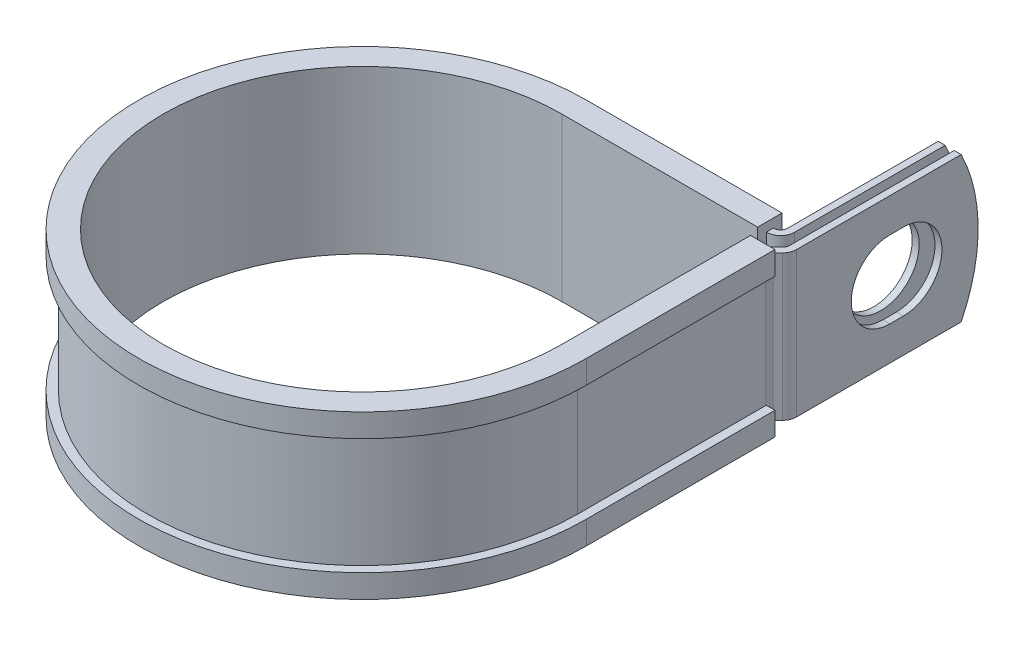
ISO-10303-21;
HEADER;
FILE_DESCRIPTION(('STEP AP214'),'2;1');
FILE_NAME('part.step','',(''),(''),'','','');
FILE_SCHEMA(('AUTOMOTIVE_DESIGN { 1 0 10303 214 1 1 1 1 }'));
ENDSEC;
DATA;
#1=APPLICATION_CONTEXT('core data for automotive mechanical design processes');
#2=APPLICATION_PROTOCOL_DEFINITION('international standard','automotive_design',2000,#1);
#3=PRODUCT_CONTEXT('',#1,'mechanical');
#4=PRODUCT('Part','Part','',(#3));
#5=PRODUCT_RELATED_PRODUCT_CATEGORY('part','',(#4));
#6=PRODUCT_DEFINITION_FORMATION('','',#4);
#7=PRODUCT_DEFINITION_CONTEXT('part definition',#1,'design');
#8=PRODUCT_DEFINITION('design','',#6,#7);
#9=PRODUCT_DEFINITION_SHAPE('','',#8);
#10=(LENGTH_UNIT() NAMED_UNIT(*) SI_UNIT(.MILLI.,.METRE.));
#11=(NAMED_UNIT(*) PLANE_ANGLE_UNIT() SI_UNIT($,.RADIAN.));
#12=(NAMED_UNIT(*) SI_UNIT($,.STERADIAN.) SOLID_ANGLE_UNIT());
#13=UNCERTAINTY_MEASURE_WITH_UNIT(LENGTH_MEASURE(1.E-05),#10,'distance_accuracy_value','');
#14=(GEOMETRIC_REPRESENTATION_CONTEXT(3) GLOBAL_UNCERTAINTY_ASSIGNED_CONTEXT((#13)) GLOBAL_UNIT_ASSIGNED_CONTEXT((#10,
#11,#12)) REPRESENTATION_CONTEXT('',''));
#15=CARTESIAN_POINT('',(0.,0.,0.));
#16=DIRECTION('',(0.,0.,1.));
#17=DIRECTION('',(1.,0.,0.));
#18=AXIS2_PLACEMENT_3D('',#15,#16,#17);
#19=CARTESIAN_POINT('',(37.1272698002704,-12.7,-36.449));
#20=DIRECTION('',(0.,1.,0.));
#21=DIRECTION('',(1.,0.,0.));
#22=AXIS2_PLACEMENT_3D('',#19,#20,#21);
#23=PLANE('',#22);
#24=DIRECTION('',(0.,0.,-1.));
#25=VECTOR('',#24,1.);
#26=CARTESIAN_POINT('',(34.2824698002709,-12.7,-36.449));
#27=LINE('',#26,#25);
#28=CARTESIAN_POINT('',(34.2824698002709,-12.7,-36.449));
#29=VERTEX_POINT('',#28);
#30=CARTESIAN_POINT('',(34.2824698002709,-12.7,-37.6682));
#31=VERTEX_POINT('',#30);
#32=EDGE_CURVE('E524',#29,#31,#27,.T.);
#33=ORIENTED_EDGE('',*,*,#32,.T.);
#34=DIRECTION('',(1.,0.,0.));
#35=VECTOR('',#34,1.);
#36=CARTESIAN_POINT('',(0.,-12.7,-37.6682));
#37=LINE('',#36,#35);
#38=CARTESIAN_POINT('',(34.3332698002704,-12.7,-37.6682));
#39=VERTEX_POINT('',#38);
#40=EDGE_CURVE('E411',#39,#31,#37,.F.);
#41=ORIENTED_EDGE('',*,*,#40,.F.);
#42=CARTESIAN_POINT('',(34.3332698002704,-12.7,-38.8874));
#43=DIRECTION('',(0.,1.,0.));
#44=DIRECTION('',(1.,0.,0.));
#45=AXIS2_PLACEMENT_3D('',#42,#43,#44);
#46=CIRCLE('',#45,1.2192);
#47=CARTESIAN_POINT('',(35.5524698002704,-12.7,-38.8874));
#48=VERTEX_POINT('',#47);
#49=EDGE_CURVE('E409',#48,#39,#46,.F.);
#50=ORIENTED_EDGE('',*,*,#49,.F.);
#51=DIRECTION('',(0.,0.,1.));
#52=VECTOR('',#51,1.);
#53=CARTESIAN_POINT('',(35.5524698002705,-12.7,-68.2498));
#54=LINE('',#53,#52);
#55=CARTESIAN_POINT('',(35.5524698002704,-12.7,-65.2724683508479));
#56=VERTEX_POINT('',#55);
#57=EDGE_CURVE('E407',#56,#48,#54,.T.);
#58=ORIENTED_EDGE('',*,*,#57,.F.);
#59=DIRECTION('',(-1.,0.,0.));
#60=VECTOR('',#59,1.);
#61=CARTESIAN_POINT('',(39.5656698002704,-12.7,-65.2724683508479));
#62=LINE('',#61,#60);
#63=CARTESIAN_POINT('',(36.7716698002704,-12.7,-65.2724683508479));
#64=VERTEX_POINT('',#63);
#65=EDGE_CURVE('E12',#64,#56,#62,.T.);
#66=ORIENTED_EDGE('',*,*,#65,.F.);
#67=DIRECTION('',(0.,0.,1.));
#68=VECTOR('',#67,1.);
#69=CARTESIAN_POINT('',(36.7716698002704,-12.7,-68.2498));
#70=LINE('',#69,#68);
#71=CARTESIAN_POINT('',(36.7716698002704,-12.7,-38.8874));
#72=VERTEX_POINT('',#71);
#73=EDGE_CURVE('E405',#64,#72,#70,.T.);
#74=ORIENTED_EDGE('',*,*,#73,.T.);
#75=CARTESIAN_POINT('',(34.3332698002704,-12.7,-38.8874));
#76=DIRECTION('',(0.,-1.,0.));
#77=DIRECTION('',(0.,0.,1.));
#78=AXIS2_PLACEMENT_3D('',#75,#76,#77);
#79=CIRCLE('',#78,2.4384);
#80=CARTESIAN_POINT('',(34.3332698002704,-12.7,-36.449));
#81=VERTEX_POINT('',#80);
#82=EDGE_CURVE('E402',#72,#81,#79,.T.);
#83=ORIENTED_EDGE('',*,*,#82,.T.);
#84=DIRECTION('',(-1.,0.,0.));
#85=VECTOR('',#84,1.);
#86=CARTESIAN_POINT('',(0.,-12.7,-36.449));
#87=LINE('',#86,#85);
#88=EDGE_CURVE('E399',#81,#29,#87,.T.);
#89=ORIENTED_EDGE('',*,*,#88,.T.);
#90=EDGE_LOOP('',(#33,#41,#50,#58,#66,#74,#83,#89));
#91=FACE_BOUND('',#90,.T.);
#92=ADVANCED_FACE('F55',(#91),#23,.F.);
#93=CARTESIAN_POINT('',(37.1272698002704,12.7,-36.449));
#94=DIRECTION('',(0.,1.,0.));
#95=DIRECTION('',(1.,0.,0.));
#96=AXIS2_PLACEMENT_3D('',#93,#94,#95);
#97=PLANE('',#96);
#98=DIRECTION('',(1.,0.,0.));
#99=VECTOR('',#98,1.);
#100=CARTESIAN_POINT('',(0.,12.7,-37.6682));
#101=LINE('',#100,#99);
#102=CARTESIAN_POINT('',(34.3332698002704,12.7,-37.6682));
#103=VERTEX_POINT('',#102);
#104=CARTESIAN_POINT('',(34.2824698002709,12.7,-37.6682));
#105=VERTEX_POINT('',#104);
#106=EDGE_CURVE('E369',#103,#105,#101,.F.);
#107=ORIENTED_EDGE('',*,*,#106,.T.);
#108=DIRECTION('',(0.,0.,1.));
#109=VECTOR('',#108,1.);
#110=CARTESIAN_POINT('',(34.2824698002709,12.7,-37.6682));
#111=LINE('',#110,#109);
#112=CARTESIAN_POINT('',(34.2824698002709,12.7,-36.449));
#113=VERTEX_POINT('',#112);
#114=EDGE_CURVE('E518',#105,#113,#111,.T.);
#115=ORIENTED_EDGE('',*,*,#114,.T.);
#116=DIRECTION('',(-1.,0.,0.));
#117=VECTOR('',#116,1.);
#118=CARTESIAN_POINT('',(0.,12.7,-36.449));
#119=LINE('',#118,#117);
#120=CARTESIAN_POINT('',(34.3332698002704,12.7,-36.449));
#121=VERTEX_POINT('',#120);
#122=EDGE_CURVE('E626',#121,#113,#119,.T.);
#123=ORIENTED_EDGE('',*,*,#122,.F.);
#124=CARTESIAN_POINT('',(34.3332698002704,12.7,-38.8874));
#125=DIRECTION('',(0.,-1.,0.));
#126=DIRECTION('',(0.,0.,1.));
#127=AXIS2_PLACEMENT_3D('',#124,#125,#126);
#128=CIRCLE('',#127,2.4384);
#129=CARTESIAN_POINT('',(36.7716698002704,12.7,-38.8874));
#130=VERTEX_POINT('',#129);
#131=EDGE_CURVE('E371',#130,#121,#128,.T.);
#132=ORIENTED_EDGE('',*,*,#131,.F.);
#133=DIRECTION('',(0.,0.,1.));
#134=VECTOR('',#133,1.);
#135=CARTESIAN_POINT('',(36.7716698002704,12.7,-68.2498));
#136=LINE('',#135,#134);
#137=CARTESIAN_POINT('',(36.7716698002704,12.7,-65.2724683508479));
#138=VERTEX_POINT('',#137);
#139=EDGE_CURVE('E362',#138,#130,#136,.T.);
#140=ORIENTED_EDGE('',*,*,#139,.F.);
#141=DIRECTION('',(-1.,0.,0.));
#142=VECTOR('',#141,1.);
#143=CARTESIAN_POINT('',(39.5656698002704,12.7,-65.2724683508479));
#144=LINE('',#143,#142);
#145=CARTESIAN_POINT('',(35.5524698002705,12.7,-65.2724683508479));
#146=VERTEX_POINT('',#145);
#147=EDGE_CURVE('E63',#138,#146,#144,.T.);
#148=ORIENTED_EDGE('',*,*,#147,.T.);
#149=DIRECTION('',(0.,0.,1.));
#150=VECTOR('',#149,1.);
#151=CARTESIAN_POINT('',(35.5524698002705,12.7,-68.2498));
#152=LINE('',#151,#150);
#153=CARTESIAN_POINT('',(35.5524698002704,12.7,-38.8874));
#154=VERTEX_POINT('',#153);
#155=EDGE_CURVE('E359',#146,#154,#152,.T.);
#156=ORIENTED_EDGE('',*,*,#155,.T.);
#157=CARTESIAN_POINT('',(34.3332698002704,12.7,-38.8874));
#158=DIRECTION('',(0.,1.,0.));
#159=DIRECTION('',(1.,0.,0.));
#160=AXIS2_PLACEMENT_3D('',#157,#158,#159);
#161=CIRCLE('',#160,1.2192);
#162=EDGE_CURVE('E367',#154,#103,#161,.F.);
#163=ORIENTED_EDGE('',*,*,#162,.T.);
#164=EDGE_LOOP('',(#107,#115,#123,#132,#140,#148,#156,#163));
#165=FACE_BOUND('',#164,.T.);
#166=ADVANCED_FACE('F358',(#165),#97,.T.);
#167=CARTESIAN_POINT('',(0.,12.7,-36.449));
#168=DIRECTION('',(0.,0.,1.));
#169=DIRECTION('',(1.,0.,0.));
#170=AXIS2_PLACEMENT_3D('',#167,#168,#169);
#171=PLANE('',#170);
#172=ORIENTED_EDGE('',*,*,#122,.T.);
#173=DIRECTION('',(0.,-1.,0.));
#174=VECTOR('',#173,1.);
#175=CARTESIAN_POINT('',(34.2824698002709,12.7,-36.449));
#176=LINE('',#175,#174);
#177=EDGE_CURVE('E521',#113,#29,#176,.T.);
#178=ORIENTED_EDGE('',*,*,#177,.T.);
#179=ORIENTED_EDGE('',*,*,#88,.F.);
#180=DIRECTION('',(0.,-1.,0.));
#181=VECTOR('',#180,1.);
#182=CARTESIAN_POINT('',(34.3332698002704,12.7,-36.449));
#183=LINE('',#182,#181);
#184=EDGE_CURVE('E345',#121,#81,#183,.T.);
#185=ORIENTED_EDGE('',*,*,#184,.F.);
#186=EDGE_LOOP('',(#172,#178,#179,#185));
#187=FACE_BOUND('',#186,.T.);
#188=ADVANCED_FACE('F636',(#187),#171,.T.);
#189=CARTESIAN_POINT('',(39.5656698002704,12.7,-36.449));
#190=DIRECTION('',(-1.,0.,0.));
#191=DIRECTION('',(0.,0.,1.));
#192=AXIS2_PLACEMENT_3D('',#189,#190,#191);
#193=PLANE('',#192);
#194=CARTESIAN_POINT('',(39.5656698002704,0.,-55.1687999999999));
#195=DIRECTION('',(1.,0.,0.));
#196=DIRECTION('',(0.,0.,-1.));
#197=AXIS2_PLACEMENT_3D('',#194,#195,#196);
#198=CIRCLE('',#197,6.7437);
#199=CARTESIAN_POINT('',(39.5656698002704,-6.7437,-55.1688000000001));
#200=VERTEX_POINT('',#199);
#201=CARTESIAN_POINT('',(39.5656698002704,6.7437,-55.1688000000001));
#202=VERTEX_POINT('',#201);
#203=EDGE_CURVE('E581',#200,#202,#198,.T.);
#204=ORIENTED_EDGE('',*,*,#203,.F.);
#205=DIRECTION('',(0.,0.,-1.));
#206=VECTOR('',#205,1.);
#207=CARTESIAN_POINT('',(39.5656698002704,-6.7437,-52.7811999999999));
#208=LINE('',#207,#206);
#209=CARTESIAN_POINT('',(39.5656698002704,-6.7437,-52.7811999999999));
#210=VERTEX_POINT('',#209);
#211=EDGE_CURVE('E584',#210,#200,#208,.T.);
#212=ORIENTED_EDGE('',*,*,#211,.F.);
#213=CARTESIAN_POINT('',(39.5656698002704,0.,-52.7811999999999));
#214=DIRECTION('',(1.,0.,0.));
#215=DIRECTION('',(0.,0.,-1.));
#216=AXIS2_PLACEMENT_3D('',#213,#214,#215);
#217=CIRCLE('',#216,6.7437);
#218=CARTESIAN_POINT('',(39.5656698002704,6.7437,-52.7811999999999));
#219=VERTEX_POINT('',#218);
#220=EDGE_CURVE('E577',#219,#210,#217,.T.);
#221=ORIENTED_EDGE('',*,*,#220,.F.);
#222=DIRECTION('',(0.,0.,1.));
#223=VECTOR('',#222,1.);
#224=CARTESIAN_POINT('',(39.5656698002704,6.7437,-52.7811999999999));
#225=LINE('',#224,#223);
#226=EDGE_CURVE('E578',#202,#219,#225,.T.);
#227=ORIENTED_EDGE('',*,*,#226,.F.);
#228=EDGE_LOOP('',(#204,#212,#221,#227));
#229=FACE_BOUND('',#228,.T.);
#230=DIRECTION('',(0.,0.,-1.));
#231=VECTOR('',#230,1.);
#232=CARTESIAN_POINT('',(39.5656698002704,-12.7,-36.449));
#233=LINE('',#232,#231);
#234=CARTESIAN_POINT('',(39.5656698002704,-12.7,-36.449));
#235=VERTEX_POINT('',#234);
#236=CARTESIAN_POINT('',(39.5656698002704,-12.7,-65.2724683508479));
#237=VERTEX_POINT('',#236);
#238=EDGE_CURVE('E383',#235,#237,#233,.T.);
#239=ORIENTED_EDGE('',*,*,#238,.T.);
#240=CARTESIAN_POINT('',(39.5656698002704,0.,-39.6748));
#241=DIRECTION('',(-1.,0.,0.));
#242=DIRECTION('',(0.,0.,1.));
#243=AXIS2_PLACEMENT_3D('',#240,#241,#242);
#244=CIRCLE('',#243,28.575);
#245=CARTESIAN_POINT('',(39.5656698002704,12.7,-65.2724683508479));
#246=VERTEX_POINT('',#245);
#247=EDGE_CURVE('E569',#246,#237,#244,.T.);
#248=ORIENTED_EDGE('',*,*,#247,.F.);
#249=DIRECTION('',(0.,0.,-1.));
#250=VECTOR('',#249,1.);
#251=CARTESIAN_POINT('',(39.5656698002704,12.7,-36.449));
#252=LINE('',#251,#250);
#253=CARTESIAN_POINT('',(39.5656698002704,12.7,-36.449));
#254=VERTEX_POINT('',#253);
#255=EDGE_CURVE('E420',#254,#246,#252,.T.);
#256=ORIENTED_EDGE('',*,*,#255,.F.);
#257=DIRECTION('',(0.,-1.,0.));
#258=VECTOR('',#257,1.);
#259=CARTESIAN_POINT('',(39.5656698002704,12.7,-36.449));
#260=LINE('',#259,#258);
#261=EDGE_CURVE('E382',#254,#235,#260,.T.);
#262=ORIENTED_EDGE('',*,*,#261,.T.);
#263=EDGE_LOOP('',(#239,#248,#256,#262));
#264=FACE_BOUND('',#263,.T.);
#265=ADVANCED_FACE('F57',(#229,#264),#193,.F.);
#266=CARTESIAN_POINT('',(38.3464698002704,12.7,-36.449));
#267=DIRECTION('',(-1.,0.,0.));
#268=DIRECTION('',(0.,0.,1.));
#269=AXIS2_PLACEMENT_3D('',#266,#267,#268);
#270=PLANE('',#269);
#271=DIRECTION('',(0.,0.,-1.));
#272=VECTOR('',#271,1.);
#273=CARTESIAN_POINT('',(38.3464698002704,-6.7437,-52.7811999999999));
#274=LINE('',#273,#272);
#275=CARTESIAN_POINT('',(38.3464698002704,-6.7437,-52.7811999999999));
#276=VERTEX_POINT('',#275);
#277=CARTESIAN_POINT('',(38.3464698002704,-6.7437,-55.1688000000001));
#278=VERTEX_POINT('',#277);
#279=EDGE_CURVE('E580',#276,#278,#274,.T.);
#280=ORIENTED_EDGE('',*,*,#279,.T.);
#281=CARTESIAN_POINT('',(38.3464698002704,0.,-55.1687999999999));
#282=DIRECTION('',(-1.,0.,0.));
#283=DIRECTION('',(0.,0.,1.));
#284=AXIS2_PLACEMENT_3D('',#281,#282,#283);
#285=CIRCLE('',#284,6.7437);
#286=CARTESIAN_POINT('',(38.3464698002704,6.7437,-55.1688000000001));
#287=VERTEX_POINT('',#286);
#288=EDGE_CURVE('E601',#278,#287,#285,.F.);
#289=ORIENTED_EDGE('',*,*,#288,.T.);
#290=DIRECTION('',(0.,0.,1.));
#291=VECTOR('',#290,1.);
#292=CARTESIAN_POINT('',(38.3464698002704,6.7437,-52.7811999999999));
#293=LINE('',#292,#291);
#294=CARTESIAN_POINT('',(38.3464698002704,6.7437,-52.7811999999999));
#295=VERTEX_POINT('',#294);
#296=EDGE_CURVE('E597',#287,#295,#293,.T.);
#297=ORIENTED_EDGE('',*,*,#296,.T.);
#298=CARTESIAN_POINT('',(38.3464698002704,0.,-52.7811999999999));
#299=DIRECTION('',(-1.,0.,0.));
#300=DIRECTION('',(0.,0.,1.));
#301=AXIS2_PLACEMENT_3D('',#298,#299,#300);
#302=CIRCLE('',#301,6.7437);
#303=EDGE_CURVE('E592',#295,#276,#302,.F.);
#304=ORIENTED_EDGE('',*,*,#303,.T.);
#305=EDGE_LOOP('',(#280,#289,#297,#304));
#306=FACE_BOUND('',#305,.T.);
#307=CARTESIAN_POINT('',(38.3464698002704,0.,-39.6748));
#308=DIRECTION('',(-1.,0.,0.));
#309=DIRECTION('',(0.,0.,1.));
#310=AXIS2_PLACEMENT_3D('',#307,#308,#309);
#311=CIRCLE('',#310,28.575);
#312=CARTESIAN_POINT('',(38.3464698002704,12.7,-65.2724683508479));
#313=VERTEX_POINT('',#312);
#314=CARTESIAN_POINT('',(38.3464698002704,-12.7,-65.2724683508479));
#315=VERTEX_POINT('',#314);
#316=EDGE_CURVE('E77',#313,#315,#311,.T.);
#317=ORIENTED_EDGE('',*,*,#316,.T.);
#318=DIRECTION('',(0.,0.,-1.));
#319=VECTOR('',#318,1.);
#320=CARTESIAN_POINT('',(38.3464698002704,-12.7,-36.449));
#321=LINE('',#320,#319);
#322=CARTESIAN_POINT('',(38.3464698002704,-12.7,-36.449));
#323=VERTEX_POINT('',#322);
#324=EDGE_CURVE('E386',#323,#315,#321,.T.);
#325=ORIENTED_EDGE('',*,*,#324,.F.);
#326=DIRECTION('',(0.,-1.,0.));
#327=VECTOR('',#326,1.);
#328=CARTESIAN_POINT('',(38.3464698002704,12.7,-36.449));
#329=LINE('',#328,#327);
#330=CARTESIAN_POINT('',(38.3464698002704,12.7,-36.449));
#331=VERTEX_POINT('',#330);
#332=EDGE_CURVE('E353',#331,#323,#329,.T.);
#333=ORIENTED_EDGE('',*,*,#332,.F.);
#334=DIRECTION('',(0.,0.,-1.));
#335=VECTOR('',#334,1.);
#336=CARTESIAN_POINT('',(38.3464698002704,12.7,-36.449));
#337=LINE('',#336,#335);
#338=EDGE_CURVE('E616',#331,#313,#337,.T.);
#339=ORIENTED_EDGE('',*,*,#338,.T.);
#340=EDGE_LOOP('',(#317,#325,#333,#339));
#341=FACE_BOUND('',#340,.T.);
#342=ADVANCED_FACE('F690',(#306,#341),#270,.T.);
#343=CARTESIAN_POINT('',(36.7716698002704,12.7,-68.2498));
#344=DIRECTION('',(1.,0.,0.));
#345=DIRECTION('',(0.,0.,-1.));
#346=AXIS2_PLACEMENT_3D('',#343,#344,#345);
#347=PLANE('',#346);
#348=CARTESIAN_POINT('',(36.7716698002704,0.,-53.975));
#349=DIRECTION('',(1.,0.,0.));
#350=DIRECTION('',(0.,0.,-1.));
#351=AXIS2_PLACEMENT_3D('',#348,#349,#350);
#352=CIRCLE('',#351,6.7437);
#353=CARTESIAN_POINT('',(36.7716698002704,0.,-60.7187));
#354=VERTEX_POINT('',#353);
#355=EDGE_CURVE('E387',#354,#354,#352,.F.);
#356=ORIENTED_EDGE('',*,*,#355,.T.);
#357=EDGE_LOOP('',(#356));
#358=FACE_BOUND('',#357,.T.);
#359=ORIENTED_EDGE('',*,*,#73,.F.);
#360=CARTESIAN_POINT('',(36.7716698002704,0.,-39.6748));
#361=DIRECTION('',(1.,0.,0.));
#362=DIRECTION('',(0.,0.,-1.));
#363=AXIS2_PLACEMENT_3D('',#360,#361,#362);
#364=CIRCLE('',#363,28.575);
#365=EDGE_CURVE('E574',#64,#138,#364,.T.);
#366=ORIENTED_EDGE('',*,*,#365,.T.);
#367=ORIENTED_EDGE('',*,*,#139,.T.);
#368=DIRECTION('',(0.,-1.,0.));
#369=VECTOR('',#368,1.);
#370=CARTESIAN_POINT('',(36.7716698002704,12.7,-38.8874));
#371=LINE('',#370,#369);
#372=EDGE_CURVE('E342',#130,#72,#371,.T.);
#373=ORIENTED_EDGE('',*,*,#372,.T.);
#374=EDGE_LOOP('',(#359,#366,#367,#373));
#375=FACE_BOUND('',#374,.T.);
#376=ADVANCED_FACE('F642',(#358,#375),#347,.T.);
#377=CARTESIAN_POINT('',(35.5524698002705,12.7,-68.2498));
#378=DIRECTION('',(1.,0.,0.));
#379=DIRECTION('',(0.,0.,-1.));
#380=AXIS2_PLACEMENT_3D('',#377,#378,#379);
#381=PLANE('',#380);
#382=CARTESIAN_POINT('',(35.5524698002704,0.,-53.975));
#383=DIRECTION('',(-1.,0.,0.));
#384=DIRECTION('',(0.,0.,1.));
#385=AXIS2_PLACEMENT_3D('',#382,#383,#384);
#386=CIRCLE('',#385,6.7437);
#387=CARTESIAN_POINT('',(35.5524698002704,0.,-47.2313));
#388=VERTEX_POINT('',#387);
#389=EDGE_CURVE('E609',#388,#388,#386,.T.);
#390=ORIENTED_EDGE('',*,*,#389,.F.);
#391=EDGE_LOOP('',(#390));
#392=FACE_BOUND('',#391,.T.);
#393=CARTESIAN_POINT('',(35.5524698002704,0.,-39.6748));
#394=DIRECTION('',(-1.,0.,0.));
#395=DIRECTION('',(0.,0.,1.));
#396=AXIS2_PLACEMENT_3D('',#393,#394,#395);
#397=CIRCLE('',#396,28.575);
#398=EDGE_CURVE('E69',#146,#56,#397,.T.);
#399=ORIENTED_EDGE('',*,*,#398,.T.);
#400=ORIENTED_EDGE('',*,*,#57,.T.);
#401=DIRECTION('',(0.,-1.,0.));
#402=VECTOR('',#401,1.);
#403=CARTESIAN_POINT('',(35.5524698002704,12.7,-38.8874));
#404=LINE('',#403,#402);
#405=EDGE_CURVE('E339',#154,#48,#404,.T.);
#406=ORIENTED_EDGE('',*,*,#405,.F.);
#407=ORIENTED_EDGE('',*,*,#155,.F.);
#408=EDGE_LOOP('',(#399,#400,#406,#407));
#409=FACE_BOUND('',#408,.T.);
#410=ADVANCED_FACE('F365',(#392,#409),#381,.F.);
#411=CARTESIAN_POINT('',(38.8874,-12.7,-33.0365026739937));
#412=DIRECTION('',(0.,1.,0.));
#413=DIRECTION('',(1.,0.,0.));
#414=AXIS2_PLACEMENT_3D('',#411,#412,#413);
#415=CIRCLE('',#414,1.2192);
#416=CARTESIAN_POINT('',(37.6682,-12.7,-33.0365026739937));
#417=VERTEX_POINT('',#416);
#418=CARTESIAN_POINT('',(38.0252954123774,-12.7,-33.8986072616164));
#419=VERTEX_POINT('',#418);
#420=EDGE_CURVE('E414',#417,#419,#415,.F.);
#421=ORIENTED_EDGE('',*,*,#420,.F.);
#422=DIRECTION('',(1.,0.,0.));
#423=VECTOR('',#422,1.);
#424=CARTESIAN_POINT('',(36.449,-12.7,-33.0365026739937));
#425=LINE('',#424,#423);
#426=CARTESIAN_POINT('',(36.449,-12.7,-33.0365026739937));
#427=VERTEX_POINT('',#426);
#428=EDGE_CURVE('E452',#427,#417,#425,.T.);
#429=ORIENTED_EDGE('',*,*,#428,.F.);
#430=CARTESIAN_POINT('',(38.8874,-12.7,-33.0365026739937));
#431=DIRECTION('',(0.,-1.,0.));
#432=DIRECTION('',(0.,0.,1.));
#433=AXIS2_PLACEMENT_3D('',#430,#431,#432);
#434=CIRCLE('',#433,2.4384);
#435=CARTESIAN_POINT('',(37.1631908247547,-12.7,-34.760711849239));
#436=VERTEX_POINT('',#435);
#437=EDGE_CURVE('E396',#427,#436,#434,.T.);
#438=ORIENTED_EDGE('',*,*,#437,.T.);
#439=DIRECTION('',(0.707106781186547,0.,-0.707106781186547));
#440=VECTOR('',#439,1.);
#441=CARTESIAN_POINT('',(37.1631908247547,-12.7,-34.760711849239));
#442=LINE('',#441,#440);
#443=CARTESIAN_POINT('',(37.9893743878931,-12.7,-35.5868954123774));
#444=VERTEX_POINT('',#443);
#445=EDGE_CURVE('E393',#436,#444,#442,.T.);
#446=ORIENTED_EDGE('',*,*,#445,.T.);
#447=CARTESIAN_POINT('',(37.1272698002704,-12.7,-36.449));
#448=DIRECTION('',(0.,1.,0.));
#449=DIRECTION('',(0.,0.,1.));
#450=AXIS2_PLACEMENT_3D('',#447,#448,#449);
#451=CIRCLE('',#450,1.21920000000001);
#452=EDGE_CURVE('E390',#444,#323,#451,.T.);
#453=ORIENTED_EDGE('',*,*,#452,.T.);
#454=ORIENTED_EDGE('',*,*,#324,.T.);
#455=DIRECTION('',(-1.,0.,0.));
#456=VECTOR('',#455,1.);
#457=CARTESIAN_POINT('',(39.5656698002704,-12.7,-65.2724683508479));
#458=LINE('',#457,#456);
#459=EDGE_CURVE('E567',#237,#315,#458,.T.);
#460=ORIENTED_EDGE('',*,*,#459,.F.);
#461=ORIENTED_EDGE('',*,*,#238,.F.);
#462=CARTESIAN_POINT('',(37.1272698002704,-12.7,-36.449));
#463=DIRECTION('',(0.,1.,0.));
#464=DIRECTION('',(1.,0.,0.));
#465=AXIS2_PLACEMENT_3D('',#462,#463,#464);
#466=CIRCLE('',#465,2.43840000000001);
#467=CARTESIAN_POINT('',(38.8514789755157,-12.7,-34.7247908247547));
#468=VERTEX_POINT('',#467);
#469=EDGE_CURVE('E418',#468,#235,#466,.T.);
#470=ORIENTED_EDGE('',*,*,#469,.F.);
#471=DIRECTION('',(0.707106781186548,0.,-0.707106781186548));
#472=VECTOR('',#471,1.);
#473=CARTESIAN_POINT('',(38.0252954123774,-12.7,-33.8986072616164));
#474=LINE('',#473,#472);
#475=EDGE_CURVE('E416',#419,#468,#474,.T.);
#476=ORIENTED_EDGE('',*,*,#475,.F.);
#477=EDGE_LOOP('',(#421,#429,#438,#446,#453,#454,#460,#461,#470,#476));
#478=FACE_BOUND('',#477,.T.);
#479=ADVANCED_FACE('F676',(#478),#23,.F.);
#480=DIRECTION('',(-1.,0.,0.));
#481=VECTOR('',#480,1.);
#482=CARTESIAN_POINT('',(37.6682,12.7,-33.0365026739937));
#483=LINE('',#482,#481);
#484=CARTESIAN_POINT('',(37.6682,12.7,-33.0365026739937));
#485=VERTEX_POINT('',#484);
#486=CARTESIAN_POINT('',(36.449,12.7,-33.0365026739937));
#487=VERTEX_POINT('',#486);
#488=EDGE_CURVE('E441',#485,#487,#483,.T.);
#489=ORIENTED_EDGE('',*,*,#488,.F.);
#490=CARTESIAN_POINT('',(38.8874,12.7,-33.0365026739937));
#491=DIRECTION('',(0.,1.,0.));
#492=DIRECTION('',(1.,0.,0.));
#493=AXIS2_PLACEMENT_3D('',#490,#491,#492);
#494=CIRCLE('',#493,1.2192);
#495=CARTESIAN_POINT('',(38.0252954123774,12.7,-33.8986072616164));
#496=VERTEX_POINT('',#495);
#497=EDGE_CURVE('E376',#485,#496,#494,.F.);
#498=ORIENTED_EDGE('',*,*,#497,.T.);
#499=DIRECTION('',(0.707106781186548,0.,-0.707106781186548));
#500=VECTOR('',#499,1.);
#501=CARTESIAN_POINT('',(38.0252954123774,12.7,-33.8986072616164));
#502=LINE('',#501,#500);
#503=CARTESIAN_POINT('',(38.8514789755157,12.7,-34.7247908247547));
#504=VERTEX_POINT('',#503);
#505=EDGE_CURVE('E378',#496,#504,#502,.T.);
#506=ORIENTED_EDGE('',*,*,#505,.T.);
#507=CARTESIAN_POINT('',(37.1272698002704,12.7,-36.449));
#508=DIRECTION('',(0.,1.,0.));
#509=DIRECTION('',(1.,0.,0.));
#510=AXIS2_PLACEMENT_3D('',#507,#508,#509);
#511=CIRCLE('',#510,2.43840000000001);
#512=EDGE_CURVE('E380',#504,#254,#511,.T.);
#513=ORIENTED_EDGE('',*,*,#512,.T.);
#514=ORIENTED_EDGE('',*,*,#255,.T.);
#515=DIRECTION('',(-1.,0.,0.));
#516=VECTOR('',#515,1.);
#517=CARTESIAN_POINT('',(39.5656698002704,12.7,-65.2724683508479));
#518=LINE('',#517,#516);
#519=EDGE_CURVE('E571',#246,#313,#518,.T.);
#520=ORIENTED_EDGE('',*,*,#519,.T.);
#521=ORIENTED_EDGE('',*,*,#338,.F.);
#522=CARTESIAN_POINT('',(37.1272698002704,12.7,-36.449));
#523=DIRECTION('',(0.,1.,0.));
#524=DIRECTION('',(0.,0.,1.));
#525=AXIS2_PLACEMENT_3D('',#522,#523,#524);
#526=CIRCLE('',#525,1.21920000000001);
#527=CARTESIAN_POINT('',(37.9893743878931,12.7,-35.5868954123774));
#528=VERTEX_POINT('',#527);
#529=EDGE_CURVE('E619',#528,#331,#526,.T.);
#530=ORIENTED_EDGE('',*,*,#529,.F.);
#531=DIRECTION('',(0.707106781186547,0.,-0.707106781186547));
#532=VECTOR('',#531,1.);
#533=CARTESIAN_POINT('',(37.1631908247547,12.7,-34.760711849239));
#534=LINE('',#533,#532);
#535=CARTESIAN_POINT('',(37.1631908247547,12.7,-34.760711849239));
#536=VERTEX_POINT('',#535);
#537=EDGE_CURVE('E622',#536,#528,#534,.T.);
#538=ORIENTED_EDGE('',*,*,#537,.F.);
#539=CARTESIAN_POINT('',(38.8874,12.7,-33.0365026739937));
#540=DIRECTION('',(0.,-1.,0.));
#541=DIRECTION('',(0.,0.,1.));
#542=AXIS2_PLACEMENT_3D('',#539,#540,#541);
#543=CIRCLE('',#542,2.4384);
#544=EDGE_CURVE('E451',#487,#536,#543,.T.);
#545=ORIENTED_EDGE('',*,*,#544,.F.);
#546=EDGE_LOOP('',(#489,#498,#506,#513,#514,#520,#521,#530,#538,#545));
#547=FACE_BOUND('',#546,.T.);
#548=ADVANCED_FACE('F448',(#547),#97,.T.);
#549=CARTESIAN_POINT('',(37.1272698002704,12.7,-36.449));
#550=DIRECTION('',(0.,-1.,0.));
#551=DIRECTION('',(0.,0.,-1.));
#552=AXIS2_PLACEMENT_3D('',#549,#550,#551);
#553=CYLINDRICAL_SURFACE('',#552,1.21920000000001);
#554=ORIENTED_EDGE('',*,*,#452,.F.);
#555=DIRECTION('',(0.,-1.,0.));
#556=VECTOR('',#555,1.);
#557=CARTESIAN_POINT('',(37.9893743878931,12.7,-35.5868954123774));
#558=LINE('',#557,#556);
#559=EDGE_CURVE('E351',#528,#444,#558,.T.);
#560=ORIENTED_EDGE('',*,*,#559,.F.);
#561=ORIENTED_EDGE('',*,*,#529,.T.);
#562=ORIENTED_EDGE('',*,*,#332,.T.);
#563=EDGE_LOOP('',(#554,#560,#561,#562));
#564=FACE_BOUND('',#563,.T.);
#565=ADVANCED_FACE('F686',(#564),#553,.F.);
#566=CARTESIAN_POINT('',(37.1631908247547,12.7,-34.760711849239));
#567=DIRECTION('',(-0.707106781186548,0.,-0.707106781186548));
#568=DIRECTION('',(-0.707106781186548,0.,0.707106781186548));
#569=AXIS2_PLACEMENT_3D('',#566,#567,#568);
#570=PLANE('',#569);
#571=ORIENTED_EDGE('',*,*,#445,.F.);
#572=DIRECTION('',(0.,-1.,0.));
#573=VECTOR('',#572,1.);
#574=CARTESIAN_POINT('',(37.1631908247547,12.7,-34.760711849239));
#575=LINE('',#574,#573);
#576=EDGE_CURVE('E349',#536,#436,#575,.T.);
#577=ORIENTED_EDGE('',*,*,#576,.F.);
#578=ORIENTED_EDGE('',*,*,#537,.T.);
#579=ORIENTED_EDGE('',*,*,#559,.T.);
#580=EDGE_LOOP('',(#571,#577,#578,#579));
#581=FACE_BOUND('',#580,.T.);
#582=ADVANCED_FACE('F681',(#581),#570,.T.);
#583=CARTESIAN_POINT('',(38.8874,12.7,-33.0365026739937));
#584=DIRECTION('',(0.,-1.,0.));
#585=DIRECTION('',(0.,0.,-1.));
#586=AXIS2_PLACEMENT_3D('',#583,#584,#585);
#587=CYLINDRICAL_SURFACE('',#586,2.4384);
#588=ORIENTED_EDGE('',*,*,#437,.F.);
#589=DIRECTION('',(0.,-1.,0.));
#590=VECTOR('',#589,1.);
#591=CARTESIAN_POINT('',(36.449,12.7,-33.0365026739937));
#592=LINE('',#591,#590);
#593=EDGE_CURVE('E347',#487,#427,#592,.T.);
#594=ORIENTED_EDGE('',*,*,#593,.F.);
#595=ORIENTED_EDGE('',*,*,#544,.T.);
#596=ORIENTED_EDGE('',*,*,#576,.T.);
#597=EDGE_LOOP('',(#588,#594,#595,#596));
#598=FACE_BOUND('',#597,.T.);
#599=ADVANCED_FACE('F678',(#598),#587,.T.);
#600=CARTESIAN_POINT('',(34.3332698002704,12.7,-38.8874));
#601=DIRECTION('',(0.,-1.,0.));
#602=DIRECTION('',(0.,0.,-1.));
#603=AXIS2_PLACEMENT_3D('',#600,#601,#602);
#604=CYLINDRICAL_SURFACE('',#603,2.4384);
#605=ORIENTED_EDGE('',*,*,#82,.F.);
#606=ORIENTED_EDGE('',*,*,#372,.F.);
#607=ORIENTED_EDGE('',*,*,#131,.T.);
#608=ORIENTED_EDGE('',*,*,#184,.T.);
#609=EDGE_LOOP('',(#605,#606,#607,#608));
#610=FACE_BOUND('',#609,.T.);
#611=ADVANCED_FACE('F632',(#610),#604,.T.);
#612=CARTESIAN_POINT('',(34.3332698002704,12.7,-38.8874));
#613=DIRECTION('',(0.,-1.,0.));
#614=DIRECTION('',(0.,0.,-1.));
#615=AXIS2_PLACEMENT_3D('',#612,#613,#614);
#616=CYLINDRICAL_SURFACE('',#615,1.2192);
#617=ORIENTED_EDGE('',*,*,#49,.T.);
#618=DIRECTION('',(0.,-1.,0.));
#619=VECTOR('',#618,1.);
#620=CARTESIAN_POINT('',(34.3332698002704,12.7,-37.6682));
#621=LINE('',#620,#619);
#622=EDGE_CURVE('E330',#103,#39,#621,.T.);
#623=ORIENTED_EDGE('',*,*,#622,.F.);
#624=ORIENTED_EDGE('',*,*,#162,.F.);
#625=ORIENTED_EDGE('',*,*,#405,.T.);
#626=EDGE_LOOP('',(#617,#623,#624,#625));
#627=FACE_BOUND('',#626,.T.);
#628=ADVANCED_FACE('F647',(#627),#616,.F.);
#629=CARTESIAN_POINT('',(0.,12.7,-37.6682));
#630=DIRECTION('',(0.,0.,1.));
#631=DIRECTION('',(1.,0.,0.));
#632=AXIS2_PLACEMENT_3D('',#629,#630,#631);
#633=PLANE('',#632);
#634=DIRECTION('',(0.,-1.,0.));
#635=VECTOR('',#634,1.);
#636=CARTESIAN_POINT('',(0.,12.7,-37.6682));
#637=LINE('',#636,#635);
#638=CARTESIAN_POINT('',(5.28377781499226E-13,10.16,-37.6682));
#639=VERTEX_POINT('',#638);
#640=CARTESIAN_POINT('',(5.28377781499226E-13,-10.16,-37.6682));
#641=VERTEX_POINT('',#640);
#642=EDGE_CURVE('E321',#639,#641,#637,.T.);
#643=ORIENTED_EDGE('',*,*,#642,.F.);
#644=DIRECTION('',(1.,0.,0.));
#645=VECTOR('',#644,1.);
#646=CARTESIAN_POINT('',(5.28377781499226E-13,10.16,-37.6682));
#647=LINE('',#646,#645);
#648=CARTESIAN_POINT('',(34.2824698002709,10.16,-37.6682));
#649=VERTEX_POINT('',#648);
#650=EDGE_CURVE('E564',#639,#649,#647,.T.);
#651=ORIENTED_EDGE('',*,*,#650,.T.);
#652=DIRECTION('',(0.,1.,0.));
#653=VECTOR('',#652,1.);
#654=CARTESIAN_POINT('',(34.2824698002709,12.7,-37.6682));
#655=LINE('',#654,#653);
#656=EDGE_CURVE('E515',#649,#105,#655,.T.);
#657=ORIENTED_EDGE('',*,*,#656,.T.);
#658=ORIENTED_EDGE('',*,*,#106,.F.);
#659=ORIENTED_EDGE('',*,*,#622,.T.);
#660=ORIENTED_EDGE('',*,*,#40,.T.);
#661=DIRECTION('',(0.,1.,0.));
#662=VECTOR('',#661,1.);
#663=CARTESIAN_POINT('',(34.2824698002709,-12.7,-37.6682));
#664=LINE('',#663,#662);
#665=CARTESIAN_POINT('',(34.2824698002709,-10.16,-37.6682));
#666=VERTEX_POINT('',#665);
#667=EDGE_CURVE('E527',#31,#666,#664,.T.);
#668=ORIENTED_EDGE('',*,*,#667,.T.);
#669=DIRECTION('',(1.,0.,0.));
#670=VECTOR('',#669,1.);
#671=CARTESIAN_POINT('',(5.28377781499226E-13,-10.16,-37.6682));
#672=LINE('',#671,#670);
#673=EDGE_CURVE('E544',#641,#666,#672,.T.);
#674=ORIENTED_EDGE('',*,*,#673,.F.);
#675=EDGE_LOOP('',(#643,#651,#657,#658,#659,#660,#668,#674));
#676=FACE_BOUND('',#675,.T.);
#677=ADVANCED_FACE('F651',(#676),#633,.F.);
#678=CARTESIAN_POINT('',(0.,12.7,0.));
#679=DIRECTION('',(0.,-1.,0.));
#680=DIRECTION('',(0.,0.,-1.));
#681=AXIS2_PLACEMENT_3D('',#678,#679,#680);
#682=CYLINDRICAL_SURFACE('',#681,37.6682);
#683=DIRECTION('',(0.,-1.,0.));
#684=VECTOR('',#683,1.);
#685=CARTESIAN_POINT('',(37.6682,12.7,0.));
#686=LINE('',#685,#684);
#687=CARTESIAN_POINT('',(37.6682,10.16,0.));
#688=VERTEX_POINT('',#687);
#689=CARTESIAN_POINT('',(37.6682,-10.16,0.));
#690=VERTEX_POINT('',#689);
#691=EDGE_CURVE('E319',#688,#690,#686,.T.);
#692=ORIENTED_EDGE('',*,*,#691,.F.);
#693=CARTESIAN_POINT('',(0.,10.16,0.));
#694=DIRECTION('',(0.,-1.,0.));
#695=DIRECTION('',(0.,0.,-1.));
#696=AXIS2_PLACEMENT_3D('',#693,#694,#695);
#697=CIRCLE('',#696,37.6682);
#698=EDGE_CURVE('E513',#688,#639,#697,.T.);
#699=ORIENTED_EDGE('',*,*,#698,.T.);
#700=ORIENTED_EDGE('',*,*,#642,.T.);
#701=CARTESIAN_POINT('',(0.,-10.16,0.));
#702=DIRECTION('',(0.,-1.,0.));
#703=DIRECTION('',(0.,0.,-1.));
#704=AXIS2_PLACEMENT_3D('',#701,#702,#703);
#705=CIRCLE('',#704,37.6682);
#706=EDGE_CURVE('E302',#690,#641,#705,.T.);
#707=ORIENTED_EDGE('',*,*,#706,.F.);
#708=EDGE_LOOP('',(#692,#699,#700,#707));
#709=FACE_BOUND('',#708,.T.);
#710=ADVANCED_FACE('F317',(#709),#682,.T.);
#711=CARTESIAN_POINT('',(37.6682,12.7,0.));
#712=DIRECTION('',(-1.,0.,0.));
#713=DIRECTION('',(0.,0.,1.));
#714=AXIS2_PLACEMENT_3D('',#711,#712,#713);
#715=PLANE('',#714);
#716=DIRECTION('',(0.,-1.,0.));
#717=VECTOR('',#716,1.);
#718=CARTESIAN_POINT('',(37.6682,12.7,-33.0365026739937));
#719=LINE('',#718,#717);
#720=CARTESIAN_POINT('',(37.6682,10.16,-33.0365026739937));
#721=VERTEX_POINT('',#720);
#722=CARTESIAN_POINT('',(37.6682,-10.16,-33.0365026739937));
#723=VERTEX_POINT('',#722);
#724=EDGE_CURVE('E333',#721,#723,#719,.T.);
#725=ORIENTED_EDGE('',*,*,#724,.F.);
#726=DIRECTION('',(0.,0.,-1.));
#727=VECTOR('',#726,1.);
#728=CARTESIAN_POINT('',(37.6682,10.16,0.));
#729=LINE('',#728,#727);
#730=EDGE_CURVE('E327',#688,#721,#729,.T.);
#731=ORIENTED_EDGE('',*,*,#730,.F.);
#732=ORIENTED_EDGE('',*,*,#691,.T.);
#733=DIRECTION('',(0.,0.,-1.));
#734=VECTOR('',#733,1.);
#735=CARTESIAN_POINT('',(37.6682,-10.16,0.));
#736=LINE('',#735,#734);
#737=EDGE_CURVE('E298',#690,#723,#736,.T.);
#738=ORIENTED_EDGE('',*,*,#737,.T.);
#739=EDGE_LOOP('',(#725,#731,#732,#738));
#740=FACE_BOUND('',#739,.T.);
#741=ADVANCED_FACE('F326',(#740),#715,.F.);
#742=CARTESIAN_POINT('',(38.8874,12.7,-33.0365026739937));
#743=DIRECTION('',(0.,-1.,0.));
#744=DIRECTION('',(0.,0.,-1.));
#745=AXIS2_PLACEMENT_3D('',#742,#743,#744);
#746=CYLINDRICAL_SURFACE('',#745,1.2192);
#747=ORIENTED_EDGE('',*,*,#420,.T.);
#748=DIRECTION('',(0.,-1.,0.));
#749=VECTOR('',#748,1.);
#750=CARTESIAN_POINT('',(38.0252954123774,12.7,-33.8986072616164));
#751=LINE('',#750,#749);
#752=EDGE_CURVE('E425',#496,#419,#751,.T.);
#753=ORIENTED_EDGE('',*,*,#752,.F.);
#754=ORIENTED_EDGE('',*,*,#497,.F.);
#755=EDGE_CURVE('E328',#485,#721,#719,.T.);
#756=ORIENTED_EDGE('',*,*,#755,.T.);
#757=ORIENTED_EDGE('',*,*,#724,.T.);
#758=DIRECTION('',(0.,1.,0.));
#759=VECTOR('',#758,1.);
#760=CARTESIAN_POINT('',(37.6682,-12.7,-33.0365026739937));
#761=LINE('',#760,#759);
#762=EDGE_CURVE('E434',#417,#723,#761,.T.);
#763=ORIENTED_EDGE('',*,*,#762,.F.);
#764=EDGE_LOOP('',(#747,#753,#754,#756,#757,#763));
#765=FACE_BOUND('',#764,.T.);
#766=ADVANCED_FACE('F433',(#765),#746,.F.);
#767=CARTESIAN_POINT('',(38.0252954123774,12.7,-33.8986072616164));
#768=DIRECTION('',(-0.707106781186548,0.,-0.707106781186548));
#769=DIRECTION('',(-0.707106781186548,0.,0.707106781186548));
#770=AXIS2_PLACEMENT_3D('',#767,#768,#769);
#771=PLANE('',#770);
#772=ORIENTED_EDGE('',*,*,#475,.T.);
#773=DIRECTION('',(0.,-1.,0.));
#774=VECTOR('',#773,1.);
#775=CARTESIAN_POINT('',(38.8514789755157,12.7,-34.7247908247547));
#776=LINE('',#775,#774);
#777=EDGE_CURVE('E423',#504,#468,#776,.T.);
#778=ORIENTED_EDGE('',*,*,#777,.F.);
#779=ORIENTED_EDGE('',*,*,#505,.F.);
#780=ORIENTED_EDGE('',*,*,#752,.T.);
#781=EDGE_LOOP('',(#772,#778,#779,#780));
#782=FACE_BOUND('',#781,.T.);
#783=ADVANCED_FACE('F702',(#782),#771,.F.);
#784=CARTESIAN_POINT('',(37.1272698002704,12.7,-36.449));
#785=DIRECTION('',(0.,-1.,0.));
#786=DIRECTION('',(0.,0.,-1.));
#787=AXIS2_PLACEMENT_3D('',#784,#785,#786);
#788=CYLINDRICAL_SURFACE('',#787,2.43840000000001);
#789=ORIENTED_EDGE('',*,*,#469,.T.);
#790=ORIENTED_EDGE('',*,*,#261,.F.);
#791=ORIENTED_EDGE('',*,*,#512,.F.);
#792=ORIENTED_EDGE('',*,*,#777,.T.);
#793=EDGE_LOOP('',(#789,#790,#791,#792));
#794=FACE_BOUND('',#793,.T.);
#795=ADVANCED_FACE('F700',(#794),#788,.T.);
#796=CARTESIAN_POINT('',(55.8457338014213,0.,-53.975));
#797=DIRECTION('',(-1.,0.,0.));
#798=DIRECTION('',(0.,0.,1.));
#799=AXIS2_PLACEMENT_3D('',#796,#797,#798);
#800=CYLINDRICAL_SURFACE('',#799,6.7437);
#801=ORIENTED_EDGE('',*,*,#389,.T.);
#802=EDGE_LOOP('',(#801));
#803=FACE_BOUND('',#802,.T.);
#804=ORIENTED_EDGE('',*,*,#355,.F.);
#805=EDGE_LOOP('',(#804));
#806=FACE_BOUND('',#805,.T.);
#807=ADVANCED_FACE('F709',(#803,#806),#800,.F.);
#808=CARTESIAN_POINT('',(17.5155892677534,-6.7437,-52.7811999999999));
#809=DIRECTION('',(0.,-1.,0.));
#810=DIRECTION('',(0.,0.,-1.));
#811=AXIS2_PLACEMENT_3D('',#808,#809,#810);
#812=PLANE('',#811);
#813=DIRECTION('',(1.,0.,0.));
#814=VECTOR('',#813,1.);
#815=CARTESIAN_POINT('',(17.5155892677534,-6.7437,-52.7811999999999));
#816=LINE('',#815,#814);
#817=EDGE_CURVE('E595',#276,#210,#816,.T.);
#818=ORIENTED_EDGE('',*,*,#817,.T.);
#819=ORIENTED_EDGE('',*,*,#211,.T.);
#820=DIRECTION('',(1.,0.,0.));
#821=VECTOR('',#820,1.);
#822=CARTESIAN_POINT('',(17.5155892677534,-6.7437,-55.1688000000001));
#823=LINE('',#822,#821);
#824=EDGE_CURVE('E591',#278,#200,#823,.T.);
#825=ORIENTED_EDGE('',*,*,#824,.F.);
#826=ORIENTED_EDGE('',*,*,#279,.F.);
#827=EDGE_LOOP('',(#818,#819,#825,#826));
#828=FACE_BOUND('',#827,.T.);
#829=ADVANCED_FACE('F752',(#828),#812,.F.);
#830=CARTESIAN_POINT('',(17.5155892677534,0.,-55.1687999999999));
#831=DIRECTION('',(1.,0.,0.));
#832=DIRECTION('',(0.,0.,-1.));
#833=AXIS2_PLACEMENT_3D('',#830,#831,#832);
#834=CYLINDRICAL_SURFACE('',#833,6.7437);
#835=ORIENTED_EDGE('',*,*,#824,.T.);
#836=ORIENTED_EDGE('',*,*,#203,.T.);
#837=DIRECTION('',(1.,0.,0.));
#838=VECTOR('',#837,1.);
#839=CARTESIAN_POINT('',(17.5155892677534,6.7437,-55.1688000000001));
#840=LINE('',#839,#838);
#841=EDGE_CURVE('E600',#287,#202,#840,.T.);
#842=ORIENTED_EDGE('',*,*,#841,.F.);
#843=ORIENTED_EDGE('',*,*,#288,.F.);
#844=EDGE_LOOP('',(#835,#836,#842,#843));
#845=FACE_BOUND('',#844,.T.);
#846=ADVANCED_FACE('F756',(#845),#834,.F.);
#847=CARTESIAN_POINT('',(17.5155892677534,6.7437,-52.7811999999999));
#848=DIRECTION('',(0.,1.,0.));
#849=DIRECTION('',(0.,0.,1.));
#850=AXIS2_PLACEMENT_3D('',#847,#848,#849);
#851=PLANE('',#850);
#852=ORIENTED_EDGE('',*,*,#841,.T.);
#853=ORIENTED_EDGE('',*,*,#226,.T.);
#854=DIRECTION('',(1.,0.,0.));
#855=VECTOR('',#854,1.);
#856=CARTESIAN_POINT('',(17.5155892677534,6.7437,-52.7811999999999));
#857=LINE('',#856,#855);
#858=EDGE_CURVE('E596',#295,#219,#857,.T.);
#859=ORIENTED_EDGE('',*,*,#858,.F.);
#860=ORIENTED_EDGE('',*,*,#296,.F.);
#861=EDGE_LOOP('',(#852,#853,#859,#860));
#862=FACE_BOUND('',#861,.T.);
#863=ADVANCED_FACE('F760',(#862),#851,.F.);
#864=CARTESIAN_POINT('',(17.5155892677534,0.,-52.7811999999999));
#865=DIRECTION('',(1.,0.,0.));
#866=DIRECTION('',(0.,0.,-1.));
#867=AXIS2_PLACEMENT_3D('',#864,#865,#866);
#868=CYLINDRICAL_SURFACE('',#867,6.7437);
#869=ORIENTED_EDGE('',*,*,#858,.T.);
#870=ORIENTED_EDGE('',*,*,#220,.T.);
#871=ORIENTED_EDGE('',*,*,#817,.F.);
#872=ORIENTED_EDGE('',*,*,#303,.F.);
#873=EDGE_LOOP('',(#869,#870,#871,#872));
#874=FACE_BOUND('',#873,.T.);
#875=ADVANCED_FACE('F764',(#874),#868,.F.);
#876=CARTESIAN_POINT('',(39.5656698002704,0.,-39.6748));
#877=DIRECTION('',(-1.,0.,0.));
#878=DIRECTION('',(0.,0.,1.));
#879=AXIS2_PLACEMENT_3D('',#876,#877,#878);
#880=CYLINDRICAL_SURFACE('',#879,28.575);
#881=ORIENTED_EDGE('',*,*,#365,.F.);
#882=ORIENTED_EDGE('',*,*,#65,.T.);
#883=ORIENTED_EDGE('',*,*,#398,.F.);
#884=ORIENTED_EDGE('',*,*,#147,.F.);
#885=EDGE_LOOP('',(#881,#882,#883,#884));
#886=FACE_BOUND('',#885,.T.);
#887=ADVANCED_FACE('F643',(#886),#880,.T.);
#888=ORIENTED_EDGE('',*,*,#519,.F.);
#889=ORIENTED_EDGE('',*,*,#247,.T.);
#890=ORIENTED_EDGE('',*,*,#459,.T.);
#891=ORIENTED_EDGE('',*,*,#316,.F.);
#892=EDGE_LOOP('',(#888,#889,#890,#891));
#893=FACE_BOUND('',#892,.T.);
#894=ADVANCED_FACE('F691',(#893),#880,.T.);
#895=CARTESIAN_POINT('',(5.49755169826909E-13,14.224,-39.1922));
#896=DIRECTION('',(0.,0.,1.));
#897=DIRECTION('',(1.,0.,0.));
#898=AXIS2_PLACEMENT_3D('',#895,#896,#897);
#899=PLANE('',#898);
#900=DIRECTION('',(0.,-1.,0.));
#901=VECTOR('',#900,1.);
#902=CARTESIAN_POINT('',(5.49755169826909E-13,14.224,-39.1922));
#903=LINE('',#902,#901);
#904=CARTESIAN_POINT('',(5.49755169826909E-13,14.224,-39.1922));
#905=VERTEX_POINT('',#904);
#906=CARTESIAN_POINT('',(5.49755169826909E-13,10.16,-39.1922));
#907=VERTEX_POINT('',#906);
#908=EDGE_CURVE('E323',#905,#907,#903,.T.);
#909=ORIENTED_EDGE('',*,*,#908,.F.);
#910=DIRECTION('',(1.,0.,0.));
#911=VECTOR('',#910,1.);
#912=CARTESIAN_POINT('',(5.49755169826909E-13,14.224,-39.1922));
#913=LINE('',#912,#911);
#914=CARTESIAN_POINT('',(34.282469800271,14.224,-39.1922));
#915=VERTEX_POINT('',#914);
#916=EDGE_CURVE('E558',#905,#915,#913,.T.);
#917=ORIENTED_EDGE('',*,*,#916,.T.);
#918=DIRECTION('',(0.,-1.,0.));
#919=VECTOR('',#918,1.);
#920=CARTESIAN_POINT('',(34.282469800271,14.224,-39.1922));
#921=LINE('',#920,#919);
#922=CARTESIAN_POINT('',(34.282469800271,10.16,-39.1922));
#923=VERTEX_POINT('',#922);
#924=EDGE_CURVE('E540',#915,#923,#921,.T.);
#925=ORIENTED_EDGE('',*,*,#924,.T.);
#926=DIRECTION('',(1.,0.,0.));
#927=VECTOR('',#926,1.);
#928=CARTESIAN_POINT('',(5.49755169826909E-13,10.16,-39.1922));
#929=LINE('',#928,#927);
#930=EDGE_CURVE('E561',#907,#923,#929,.T.);
#931=ORIENTED_EDGE('',*,*,#930,.F.);
#932=EDGE_LOOP('',(#909,#917,#925,#931));
#933=FACE_BOUND('',#932,.T.);
#934=ADVANCED_FACE('F855',(#933),#899,.F.);
#935=CARTESIAN_POINT('',(4.89898482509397E-13,14.224,-34.925));
#936=DIRECTION('',(0.,0.,-1.));
#937=DIRECTION('',(0.,1.,0.));
#938=AXIS2_PLACEMENT_3D('',#935,#936,#937);
#939=PLANE('',#938);
#940=DIRECTION('',(0.,1.,0.));
#941=VECTOR('',#940,1.);
#942=CARTESIAN_POINT('',(4.89898482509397E-13,14.224,-34.925));
#943=LINE('',#942,#941);
#944=CARTESIAN_POINT('',(4.89898482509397E-13,-14.224,-34.925));
#945=VERTEX_POINT('',#944);
#946=CARTESIAN_POINT('',(4.89898482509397E-13,14.224,-34.925));
#947=VERTEX_POINT('',#946);
#948=EDGE_CURVE('E491',#945,#947,#943,.T.);
#949=ORIENTED_EDGE('',*,*,#948,.F.);
#950=DIRECTION('',(1.,0.,0.));
#951=VECTOR('',#950,1.);
#952=CARTESIAN_POINT('',(4.89898482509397E-13,-14.224,-34.925));
#953=LINE('',#952,#951);
#954=CARTESIAN_POINT('',(34.2824698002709,-14.224,-34.925));
#955=VERTEX_POINT('',#954);
#956=EDGE_CURVE('E552',#945,#955,#953,.T.);
#957=ORIENTED_EDGE('',*,*,#956,.T.);
#958=DIRECTION('',(0.,1.,0.));
#959=VECTOR('',#958,1.);
#960=CARTESIAN_POINT('',(34.2824698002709,14.224,-34.925));
#961=LINE('',#960,#959);
#962=CARTESIAN_POINT('',(34.2824698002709,14.224,-34.925));
#963=VERTEX_POINT('',#962);
#964=EDGE_CURVE('E536',#955,#963,#961,.T.);
#965=ORIENTED_EDGE('',*,*,#964,.T.);
#966=DIRECTION('',(1.,0.,0.));
#967=VECTOR('',#966,1.);
#968=CARTESIAN_POINT('',(4.89898482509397E-13,14.224,-34.925));
#969=LINE('',#968,#967);
#970=EDGE_CURVE('E555',#947,#963,#969,.T.);
#971=ORIENTED_EDGE('',*,*,#970,.F.);
#972=EDGE_LOOP('',(#949,#957,#965,#971));
#973=FACE_BOUND('',#972,.T.);
#974=ADVANCED_FACE('F941',(#973),#939,.F.);
#975=CARTESIAN_POINT('',(5.49755169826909E-13,-14.224,-39.1922));
#976=DIRECTION('',(0.,0.,1.));
#977=DIRECTION('',(1.,0.,0.));
#978=AXIS2_PLACEMENT_3D('',#975,#976,#977);
#979=PLANE('',#978);
#980=DIRECTION('',(0.,-1.,0.));
#981=VECTOR('',#980,1.);
#982=CARTESIAN_POINT('',(5.49755169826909E-13,-14.224,-39.1922));
#983=LINE('',#982,#981);
#984=CARTESIAN_POINT('',(5.49755169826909E-13,-10.16,-39.1922));
#985=VERTEX_POINT('',#984);
#986=CARTESIAN_POINT('',(5.49755169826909E-13,-14.224,-39.1922));
#987=VERTEX_POINT('',#986);
#988=EDGE_CURVE('E477',#985,#987,#983,.T.);
#989=ORIENTED_EDGE('',*,*,#988,.F.);
#990=DIRECTION('',(1.,0.,0.));
#991=VECTOR('',#990,1.);
#992=CARTESIAN_POINT('',(5.49755169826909E-13,-10.16,-39.1922));
#993=LINE('',#992,#991);
#994=CARTESIAN_POINT('',(34.282469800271,-10.16,-39.1922));
#995=VERTEX_POINT('',#994);
#996=EDGE_CURVE('E546',#985,#995,#993,.T.);
#997=ORIENTED_EDGE('',*,*,#996,.T.);
#998=DIRECTION('',(0.,-1.,0.));
#999=VECTOR('',#998,1.);
#1000=CARTESIAN_POINT('',(34.282469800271,-14.224,-39.1922));
#1001=LINE('',#1000,#999);
#1002=CARTESIAN_POINT('',(34.282469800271,-14.224,-39.1922));
#1003=VERTEX_POINT('',#1002);
#1004=EDGE_CURVE('E532',#995,#1003,#1001,.T.);
#1005=ORIENTED_EDGE('',*,*,#1004,.T.);
#1006=DIRECTION('',(1.,0.,0.));
#1007=VECTOR('',#1006,1.);
#1008=CARTESIAN_POINT('',(5.49755169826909E-13,-14.224,-39.1922));
#1009=LINE('',#1008,#1007);
#1010=EDGE_CURVE('E549',#987,#1003,#1009,.T.);
#1011=ORIENTED_EDGE('',*,*,#1010,.F.);
#1012=EDGE_LOOP('',(#989,#997,#1005,#1011));
#1013=FACE_BOUND('',#1012,.T.);
#1014=ADVANCED_FACE('F662',(#1013),#979,.F.);
#1015=CARTESIAN_POINT('',(0.,12.7,0.));
#1016=DIRECTION('',(0.,-1.,0.));
#1017=DIRECTION('',(0.,0.,-1.));
#1018=AXIS2_PLACEMENT_3D('',#1015,#1016,#1017);
#1019=CYLINDRICAL_SURFACE('',#1018,39.1922);
#1020=DIRECTION('',(0.,-1.,0.));
#1021=VECTOR('',#1020,1.);
#1022=CARTESIAN_POINT('',(39.1922,14.224,0.));
#1023=LINE('',#1022,#1021);
#1024=CARTESIAN_POINT('',(39.1922,14.224,0.));
#1025=VERTEX_POINT('',#1024);
#1026=CARTESIAN_POINT('',(39.1922,10.16,0.));
#1027=VERTEX_POINT('',#1026);
#1028=EDGE_CURVE('E312',#1025,#1027,#1023,.T.);
#1029=ORIENTED_EDGE('',*,*,#1028,.F.);
#1030=CARTESIAN_POINT('',(0.,14.224,0.));
#1031=DIRECTION('',(0.,-1.,0.));
#1032=DIRECTION('',(0.,0.,-1.));
#1033=AXIS2_PLACEMENT_3D('',#1030,#1031,#1032);
#1034=CIRCLE('',#1033,39.1922);
#1035=EDGE_CURVE('E507',#1025,#905,#1034,.T.);
#1036=ORIENTED_EDGE('',*,*,#1035,.T.);
#1037=ORIENTED_EDGE('',*,*,#908,.T.);
#1038=CARTESIAN_POINT('',(0.,10.16,0.));
#1039=DIRECTION('',(0.,-1.,0.));
#1040=DIRECTION('',(0.,0.,-1.));
#1041=AXIS2_PLACEMENT_3D('',#1038,#1039,#1040);
#1042=CIRCLE('',#1041,39.1922);
#1043=EDGE_CURVE('E510',#1027,#907,#1042,.T.);
#1044=ORIENTED_EDGE('',*,*,#1043,.F.);
#1045=EDGE_LOOP('',(#1029,#1036,#1037,#1044));
#1046=FACE_BOUND('',#1045,.T.);
#1047=ADVANCED_FACE('F961',(#1046),#1019,.T.);
#1048=CARTESIAN_POINT('',(0.,12.7,0.));
#1049=DIRECTION('',(0.,-1.,0.));
#1050=DIRECTION('',(0.,0.,-1.));
#1051=AXIS2_PLACEMENT_3D('',#1048,#1049,#1050);
#1052=CYLINDRICAL_SURFACE('',#1051,34.925);
#1053=DIRECTION('',(0.,1.,0.));
#1054=VECTOR('',#1053,1.);
#1055=CARTESIAN_POINT('',(34.925,14.224,0.));
#1056=LINE('',#1055,#1054);
#1057=CARTESIAN_POINT('',(34.925,-14.224,0.));
#1058=VERTEX_POINT('',#1057);
#1059=CARTESIAN_POINT('',(34.925,14.224,0.));
#1060=VERTEX_POINT('',#1059);
#1061=EDGE_CURVE('E1124',#1058,#1060,#1056,.T.);
#1062=ORIENTED_EDGE('',*,*,#1061,.F.);
#1063=CARTESIAN_POINT('',(0.,-14.224,0.));
#1064=DIRECTION('',(0.,-1.,0.));
#1065=DIRECTION('',(0.,0.,-1.));
#1066=AXIS2_PLACEMENT_3D('',#1063,#1064,#1065);
#1067=CIRCLE('',#1066,34.925);
#1068=EDGE_CURVE('E501',#1058,#945,#1067,.T.);
#1069=ORIENTED_EDGE('',*,*,#1068,.T.);
#1070=ORIENTED_EDGE('',*,*,#948,.T.);
#1071=CARTESIAN_POINT('',(0.,14.224,0.));
#1072=DIRECTION('',(0.,-1.,0.));
#1073=DIRECTION('',(0.,0.,-1.));
#1074=AXIS2_PLACEMENT_3D('',#1071,#1072,#1073);
#1075=CIRCLE('',#1074,34.925);
#1076=EDGE_CURVE('E504',#1060,#947,#1075,.T.);
#1077=ORIENTED_EDGE('',*,*,#1076,.F.);
#1078=EDGE_LOOP('',(#1062,#1069,#1070,#1077));
#1079=FACE_BOUND('',#1078,.T.);
#1080=ADVANCED_FACE('F971',(#1079),#1052,.F.);
#1081=CARTESIAN_POINT('',(0.,12.7,0.));
#1082=DIRECTION('',(0.,-1.,0.));
#1083=DIRECTION('',(0.,0.,-1.));
#1084=AXIS2_PLACEMENT_3D('',#1081,#1082,#1083);
#1085=CYLINDRICAL_SURFACE('',#1084,39.1922);
#1086=DIRECTION('',(0.,-1.,0.));
#1087=VECTOR('',#1086,1.);
#1088=CARTESIAN_POINT('',(39.1922,-14.224,0.));
#1089=LINE('',#1088,#1087);
#1090=CARTESIAN_POINT('',(39.1922,-10.16,0.));
#1091=VERTEX_POINT('',#1090);
#1092=CARTESIAN_POINT('',(39.1922,-14.224,0.));
#1093=VERTEX_POINT('',#1092);
#1094=EDGE_CURVE('E475',#1091,#1093,#1089,.T.);
#1095=ORIENTED_EDGE('',*,*,#1094,.F.);
#1096=CARTESIAN_POINT('',(0.,-10.16,0.));
#1097=DIRECTION('',(0.,-1.,0.));
#1098=DIRECTION('',(0.,0.,-1.));
#1099=AXIS2_PLACEMENT_3D('',#1096,#1097,#1098);
#1100=CIRCLE('',#1099,39.1922);
#1101=EDGE_CURVE('E322',#1091,#985,#1100,.T.);
#1102=ORIENTED_EDGE('',*,*,#1101,.T.);
#1103=ORIENTED_EDGE('',*,*,#988,.T.);
#1104=CARTESIAN_POINT('',(0.,-14.224,0.));
#1105=DIRECTION('',(0.,-1.,0.));
#1106=DIRECTION('',(0.,0.,-1.));
#1107=AXIS2_PLACEMENT_3D('',#1104,#1105,#1106);
#1108=CIRCLE('',#1107,39.1922);
#1109=EDGE_CURVE('E498',#1093,#987,#1108,.T.);
#1110=ORIENTED_EDGE('',*,*,#1109,.F.);
#1111=EDGE_LOOP('',(#1095,#1102,#1103,#1110));
#1112=FACE_BOUND('',#1111,.T.);
#1113=ADVANCED_FACE('F665',(#1112),#1085,.T.);
#1114=CARTESIAN_POINT('',(39.1922,10.16,0.));
#1115=DIRECTION('',(0.,-1.,0.));
#1116=DIRECTION('',(0.,0.,-1.));
#1117=AXIS2_PLACEMENT_3D('',#1114,#1115,#1116);
#1118=PLANE('',#1117);
#1119=DIRECTION('',(-1.,0.,0.));
#1120=VECTOR('',#1119,1.);
#1121=CARTESIAN_POINT('',(39.1922,10.16,-33.0365026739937));
#1122=LINE('',#1121,#1120);
#1123=CARTESIAN_POINT('',(39.1922,10.16,-33.0365026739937));
#1124=VERTEX_POINT('',#1123);
#1125=EDGE_CURVE('E445',#1124,#721,#1122,.T.);
#1126=ORIENTED_EDGE('',*,*,#1125,.F.);
#1127=DIRECTION('',(0.,0.,-1.));
#1128=VECTOR('',#1127,1.);
#1129=CARTESIAN_POINT('',(39.1922,10.16,0.));
#1130=LINE('',#1129,#1128);
#1131=EDGE_CURVE('E478',#1027,#1124,#1130,.T.);
#1132=ORIENTED_EDGE('',*,*,#1131,.F.);
#1133=ORIENTED_EDGE('',*,*,#1043,.T.);
#1134=ORIENTED_EDGE('',*,*,#930,.T.);
#1135=DIRECTION('',(0.,0.,1.));
#1136=VECTOR('',#1135,1.);
#1137=CARTESIAN_POINT('',(34.282469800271,10.16,-39.1922));
#1138=LINE('',#1137,#1136);
#1139=EDGE_CURVE('E542',#923,#649,#1138,.T.);
#1140=ORIENTED_EDGE('',*,*,#1139,.T.);
#1141=ORIENTED_EDGE('',*,*,#650,.F.);
#1142=ORIENTED_EDGE('',*,*,#698,.F.);
#1143=ORIENTED_EDGE('',*,*,#730,.T.);
#1144=EDGE_LOOP('',(#1126,#1132,#1133,#1134,#1140,#1141,#1142,#1143));
#1145=FACE_BOUND('',#1144,.T.);
#1146=ADVANCED_FACE('F992',(#1145),#1118,.T.);
#1147=CARTESIAN_POINT('',(39.1922,14.224,0.));
#1148=DIRECTION('',(1.,0.,0.));
#1149=DIRECTION('',(0.,0.,-1.));
#1150=AXIS2_PLACEMENT_3D('',#1147,#1148,#1149);
#1151=PLANE('',#1150);
#1152=DIRECTION('',(0.,-1.,0.));
#1153=VECTOR('',#1152,1.);
#1154=CARTESIAN_POINT('',(39.1922,14.224,-33.0365026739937));
#1155=LINE('',#1154,#1153);
#1156=CARTESIAN_POINT('',(39.1922,14.224,-33.0365026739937));
#1157=VERTEX_POINT('',#1156);
#1158=EDGE_CURVE('E472',#1157,#1124,#1155,.T.);
#1159=ORIENTED_EDGE('',*,*,#1158,.F.);
#1160=DIRECTION('',(0.,0.,-1.));
#1161=VECTOR('',#1160,1.);
#1162=CARTESIAN_POINT('',(39.1922,14.224,0.));
#1163=LINE('',#1162,#1161);
#1164=EDGE_CURVE('E480',#1025,#1157,#1163,.T.);
#1165=ORIENTED_EDGE('',*,*,#1164,.F.);
#1166=ORIENTED_EDGE('',*,*,#1028,.T.);
#1167=ORIENTED_EDGE('',*,*,#1131,.T.);
#1168=EDGE_LOOP('',(#1159,#1165,#1166,#1167));
#1169=FACE_BOUND('',#1168,.T.);
#1170=ADVANCED_FACE('F1003',(#1169),#1151,.T.);
#1171=CARTESIAN_POINT('',(39.1922,14.224,0.));
#1172=DIRECTION('',(0.,1.,0.));
#1173=DIRECTION('',(0.,0.,1.));
#1174=AXIS2_PLACEMENT_3D('',#1171,#1172,#1173);
#1175=PLANE('',#1174);
#1176=DIRECTION('',(1.,0.,0.));
#1177=VECTOR('',#1176,1.);
#1178=CARTESIAN_POINT('',(39.1922,14.224,-33.0365026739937));
#1179=LINE('',#1178,#1177);
#1180=CARTESIAN_POINT('',(34.925,14.224,-33.0365026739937));
#1181=VERTEX_POINT('',#1180);
#1182=EDGE_CURVE('E469',#1181,#1157,#1179,.T.);
#1183=ORIENTED_EDGE('',*,*,#1182,.F.);
#1184=DIRECTION('',(0.,0.,-1.));
#1185=VECTOR('',#1184,1.);
#1186=CARTESIAN_POINT('',(34.925,14.224,0.));
#1187=LINE('',#1186,#1185);
#1188=EDGE_CURVE('E482',#1060,#1181,#1187,.T.);
#1189=ORIENTED_EDGE('',*,*,#1188,.F.);
#1190=ORIENTED_EDGE('',*,*,#1076,.T.);
#1191=ORIENTED_EDGE('',*,*,#970,.T.);
#1192=DIRECTION('',(0.,0.,-1.));
#1193=VECTOR('',#1192,1.);
#1194=CARTESIAN_POINT('',(34.282469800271,14.224,-39.1922));
#1195=LINE('',#1194,#1193);
#1196=EDGE_CURVE('E538',#963,#915,#1195,.T.);
#1197=ORIENTED_EDGE('',*,*,#1196,.T.);
#1198=ORIENTED_EDGE('',*,*,#916,.F.);
#1199=ORIENTED_EDGE('',*,*,#1035,.F.);
#1200=ORIENTED_EDGE('',*,*,#1164,.T.);
#1201=EDGE_LOOP('',(#1183,#1189,#1190,#1191,#1197,#1198,#1199,#1200));
#1202=FACE_BOUND('',#1201,.T.);
#1203=ADVANCED_FACE('F1015',(#1202),#1175,.T.);
#1204=CARTESIAN_POINT('',(34.925,14.224,0.));
#1205=DIRECTION('',(-1.,0.,0.));
#1206=DIRECTION('',(0.,-1.,0.));
#1207=AXIS2_PLACEMENT_3D('',#1204,#1205,#1206);
#1208=PLANE('',#1207);
#1209=DIRECTION('',(0.,1.,0.));
#1210=VECTOR('',#1209,1.);
#1211=CARTESIAN_POINT('',(34.925,14.224,-33.0365026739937));
#1212=LINE('',#1211,#1210);
#1213=CARTESIAN_POINT('',(34.925,-14.224,-33.0365026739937));
#1214=VERTEX_POINT('',#1213);
#1215=EDGE_CURVE('E466',#1214,#1181,#1212,.T.);
#1216=ORIENTED_EDGE('',*,*,#1215,.F.);
#1217=DIRECTION('',(0.,0.,-1.));
#1218=VECTOR('',#1217,1.);
#1219=CARTESIAN_POINT('',(34.925,-14.224,0.));
#1220=LINE('',#1219,#1218);
#1221=EDGE_CURVE('E484',#1058,#1214,#1220,.T.);
#1222=ORIENTED_EDGE('',*,*,#1221,.F.);
#1223=ORIENTED_EDGE('',*,*,#1061,.T.);
#1224=ORIENTED_EDGE('',*,*,#1188,.T.);
#1225=EDGE_LOOP('',(#1216,#1222,#1223,#1224));
#1226=FACE_BOUND('',#1225,.T.);
#1227=ADVANCED_FACE('F1027',(#1226),#1208,.T.);
#1228=CARTESIAN_POINT('',(34.925,-14.224,0.));
#1229=DIRECTION('',(0.,-1.,0.));
#1230=DIRECTION('',(0.,0.,-1.));
#1231=AXIS2_PLACEMENT_3D('',#1228,#1229,#1230);
#1232=PLANE('',#1231);
#1233=DIRECTION('',(-1.,0.,0.));
#1234=VECTOR('',#1233,1.);
#1235=CARTESIAN_POINT('',(34.925,-14.224,-33.0365026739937));
#1236=LINE('',#1235,#1234);
#1237=CARTESIAN_POINT('',(39.1922,-14.224,-33.0365026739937));
#1238=VERTEX_POINT('',#1237);
#1239=EDGE_CURVE('E463',#1238,#1214,#1236,.T.);
#1240=ORIENTED_EDGE('',*,*,#1239,.F.);
#1241=DIRECTION('',(0.,0.,-1.));
#1242=VECTOR('',#1241,1.);
#1243=CARTESIAN_POINT('',(39.1922,-14.224,0.));
#1244=LINE('',#1243,#1242);
#1245=EDGE_CURVE('E486',#1093,#1238,#1244,.T.);
#1246=ORIENTED_EDGE('',*,*,#1245,.F.);
#1247=ORIENTED_EDGE('',*,*,#1109,.T.);
#1248=ORIENTED_EDGE('',*,*,#1010,.T.);
#1249=DIRECTION('',(0.,0.,1.));
#1250=VECTOR('',#1249,1.);
#1251=CARTESIAN_POINT('',(34.2824698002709,-14.224,-34.925));
#1252=LINE('',#1251,#1250);
#1253=EDGE_CURVE('E534',#1003,#955,#1252,.T.);
#1254=ORIENTED_EDGE('',*,*,#1253,.T.);
#1255=ORIENTED_EDGE('',*,*,#956,.F.);
#1256=ORIENTED_EDGE('',*,*,#1068,.F.);
#1257=ORIENTED_EDGE('',*,*,#1221,.T.);
#1258=EDGE_LOOP('',(#1240,#1246,#1247,#1248,#1254,#1255,#1256,#1257));
#1259=FACE_BOUND('',#1258,.T.);
#1260=ADVANCED_FACE('F1039',(#1259),#1232,.T.);
#1261=CARTESIAN_POINT('',(39.1922,-14.224,0.));
#1262=DIRECTION('',(1.,0.,0.));
#1263=DIRECTION('',(0.,0.,-1.));
#1264=AXIS2_PLACEMENT_3D('',#1261,#1262,#1263);
#1265=PLANE('',#1264);
#1266=DIRECTION('',(0.,-1.,0.));
#1267=VECTOR('',#1266,1.);
#1268=CARTESIAN_POINT('',(39.1922,-14.224,-33.0365026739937));
#1269=LINE('',#1268,#1267);
#1270=CARTESIAN_POINT('',(39.1922,-10.16,-33.0365026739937));
#1271=VERTEX_POINT('',#1270);
#1272=EDGE_CURVE('E460',#1271,#1238,#1269,.T.);
#1273=ORIENTED_EDGE('',*,*,#1272,.F.);
#1274=DIRECTION('',(0.,0.,-1.));
#1275=VECTOR('',#1274,1.);
#1276=CARTESIAN_POINT('',(39.1922,-10.16,0.));
#1277=LINE('',#1276,#1275);
#1278=EDGE_CURVE('E311',#1091,#1271,#1277,.T.);
#1279=ORIENTED_EDGE('',*,*,#1278,.F.);
#1280=ORIENTED_EDGE('',*,*,#1094,.T.);
#1281=ORIENTED_EDGE('',*,*,#1245,.T.);
#1282=EDGE_LOOP('',(#1273,#1279,#1280,#1281));
#1283=FACE_BOUND('',#1282,.T.);
#1284=ADVANCED_FACE('F670',(#1283),#1265,.T.);
#1285=CARTESIAN_POINT('',(37.6682,-10.16,0.));
#1286=DIRECTION('',(0.,1.,0.));
#1287=DIRECTION('',(0.,0.,1.));
#1288=AXIS2_PLACEMENT_3D('',#1285,#1286,#1287);
#1289=PLANE('',#1288);
#1290=DIRECTION('',(1.,0.,0.));
#1291=VECTOR('',#1290,1.);
#1292=CARTESIAN_POINT('',(37.6682,-10.16,-33.0365026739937));
#1293=LINE('',#1292,#1291);
#1294=EDGE_CURVE('E305',#723,#1271,#1293,.T.);
#1295=ORIENTED_EDGE('',*,*,#1294,.F.);
#1296=ORIENTED_EDGE('',*,*,#737,.F.);
#1297=ORIENTED_EDGE('',*,*,#706,.T.);
#1298=ORIENTED_EDGE('',*,*,#673,.T.);
#1299=DIRECTION('',(0.,0.,-1.));
#1300=VECTOR('',#1299,1.);
#1301=CARTESIAN_POINT('',(34.2824698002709,-10.16,-37.6682));
#1302=LINE('',#1301,#1300);
#1303=EDGE_CURVE('E530',#666,#995,#1302,.T.);
#1304=ORIENTED_EDGE('',*,*,#1303,.T.);
#1305=ORIENTED_EDGE('',*,*,#996,.F.);
#1306=ORIENTED_EDGE('',*,*,#1101,.F.);
#1307=ORIENTED_EDGE('',*,*,#1278,.T.);
#1308=EDGE_LOOP('',(#1295,#1296,#1297,#1298,#1304,#1305,#1306,#1307));
#1309=FACE_BOUND('',#1308,.T.);
#1310=ADVANCED_FACE('F300',(#1309),#1289,.T.);
#1311=CARTESIAN_POINT('',(34.2824698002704,0.,0.));
#1312=DIRECTION('',(-1.,0.,0.));
#1313=DIRECTION('',(0.,0.,1.));
#1314=AXIS2_PLACEMENT_3D('',#1311,#1312,#1313);
#1315=PLANE('',#1314);
#1316=ORIENTED_EDGE('',*,*,#656,.F.);
#1317=ORIENTED_EDGE('',*,*,#1139,.F.);
#1318=ORIENTED_EDGE('',*,*,#924,.F.);
#1319=ORIENTED_EDGE('',*,*,#1196,.F.);
#1320=ORIENTED_EDGE('',*,*,#964,.F.);
#1321=ORIENTED_EDGE('',*,*,#1253,.F.);
#1322=ORIENTED_EDGE('',*,*,#1004,.F.);
#1323=ORIENTED_EDGE('',*,*,#1303,.F.);
#1324=ORIENTED_EDGE('',*,*,#667,.F.);
#1325=ORIENTED_EDGE('',*,*,#32,.F.);
#1326=ORIENTED_EDGE('',*,*,#177,.F.);
#1327=ORIENTED_EDGE('',*,*,#114,.F.);
#1328=EDGE_LOOP('',(#1316,#1317,#1318,#1319,#1320,#1321,#1322,#1323,#1324,#1325,#1326,#1327));
#1329=FACE_BOUND('',#1328,.T.);
#1330=ADVANCED_FACE('F655',(#1329),#1315,.F.);
#1331=CARTESIAN_POINT('',(0.,0.,-33.0365026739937));
#1332=DIRECTION('',(0.,0.,-1.));
#1333=DIRECTION('',(-1.,0.,0.));
#1334=AXIS2_PLACEMENT_3D('',#1331,#1332,#1333);
#1335=PLANE('',#1334);
#1336=ORIENTED_EDGE('',*,*,#755,.F.);
#1337=ORIENTED_EDGE('',*,*,#488,.T.);
#1338=ORIENTED_EDGE('',*,*,#593,.T.);
#1339=ORIENTED_EDGE('',*,*,#428,.T.);
#1340=ORIENTED_EDGE('',*,*,#762,.T.);
#1341=ORIENTED_EDGE('',*,*,#1294,.T.);
#1342=ORIENTED_EDGE('',*,*,#1272,.T.);
#1343=ORIENTED_EDGE('',*,*,#1239,.T.);
#1344=ORIENTED_EDGE('',*,*,#1215,.T.);
#1345=ORIENTED_EDGE('',*,*,#1182,.T.);
#1346=ORIENTED_EDGE('',*,*,#1158,.T.);
#1347=ORIENTED_EDGE('',*,*,#1125,.T.);
#1348=EDGE_LOOP('',(#1336,#1337,#1338,#1339,#1340,#1341,#1342,#1343,#1344,#1345,#1346,#1347));
#1349=FACE_BOUND('',#1348,.T.);
#1350=ADVANCED_FACE('F440',(#1349),#1335,.T.);
#1351=CLOSED_SHELL('',(#92,#166,#188,#265,#342,#376,#410,#479,#548,#565,#582,#599,#611,#628,
#677,#710,#741,#766,#783,#795,#807,#829,#846,#863,#875,#887,#894,#934,#974,#1014,#1047,#1080,
#1113,#1146,#1170,#1203,#1227,#1260,#1284,#1310,#1330,#1350));
#1352=MANIFOLD_SOLID_BREP('B2',#1351);
#1353=ADVANCED_BREP_SHAPE_REPRESENTATION('',(#18,#1352),#14);
#1354=SHAPE_DEFINITION_REPRESENTATION(#9,#1353);
ENDSEC;
END-ISO-10303-21;
